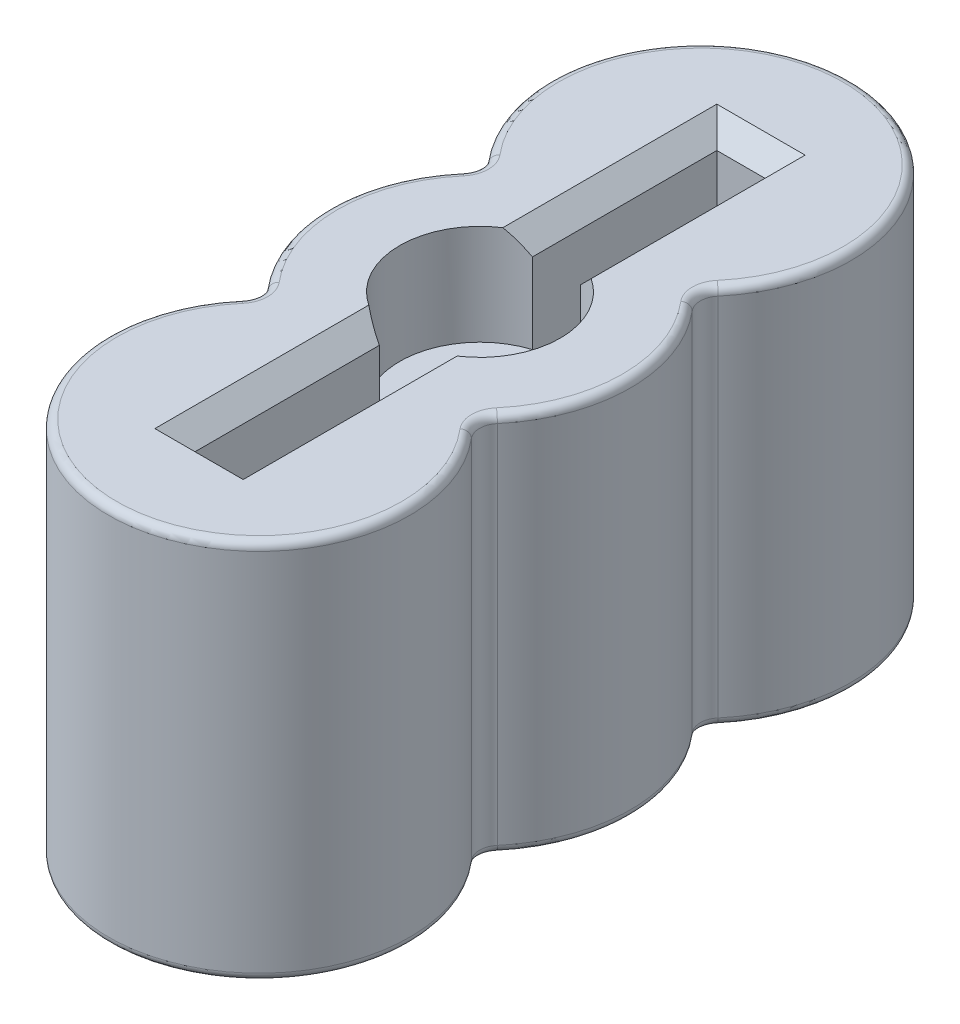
from build123d import *

# Parameters (mm, degrees)
BOSS_EXTRUDE1_DEPTH = 9.5
BOSS_EXTRUDE2_START = -9.5
BOSS_EXTRUDE2_DEPTH = 9.5
SKETCH3_W           = 1.2
SKETCH3_H           = 13
CUT_EXTRUDE1_DEPTH  = 14.77951378
CUT_EXTRUDE2_DEPTH  = 2.5
CUT_EXTRUDE3_START  = -2.5
CUT_EXTRUDE3_DEPTH  = 2.5
CUT_EXTRUDE4_DEPTH  = 2.5
CUT_EXTRUDE5_START  = -2.5
CUT_EXTRUDE5_DEPTH  = 2.5
FILLET1_R           = 0.5
CHAMFER1_SIZE       = 0.5
FILLET2_R           = 0.2


with BuildPart() as part:
    # Sketch1 → Boss-Extrude1 (new body)
    with BuildSketch(Plane.XZ.offset(4.75)):
        with BuildLine():
            ThreePointArc((-2.549509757, 2.75), (0, -3.75), (2.549509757, 2.75))
            ThreePointArc((2.549509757, 2.75), (0, 9.25), (-2.549509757, 2.75))
        make_face()
    extrude(amount=-BOSS_EXTRUDE1_DEPTH)

    # Sketch2 → Boss-Extrude2 (add)
    with BuildSketch(Plane(origin=(0, 4.75, 0), x_dir=(1, 0, 0), z_dir=(0, 1, 0)).offset(BOSS_EXTRUDE2_START)):
        with BuildLine():
            ThreePointArc((2.549509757, 2.75), (0, 9.25), (-2.549509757, 2.75))
            ThreePointArc((-2.549509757, 2.75), (0, 3.75), (2.549509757, 2.75))
        make_face()
    extrude(amount=BOSS_EXTRUDE2_DEPTH)

    # Sketch3 → Cut-Extrude1 (cut, through all)
    with BuildSketch(Plane(origin=(0, 4.75, 0), x_dir=(-1, 0, 0), z_dir=(0, 1, 0))):
        Rectangle(SKETCH3_W, SKETCH3_H)
    extrude(amount=-CUT_EXTRUDE1_DEPTH, mode=Mode.SUBTRACT)

    # Sketch4 → Cut-Extrude2 (cut)
    with BuildSketch(Plane.XZ.offset(4.75)):
        with BuildLine():
            Line((-0.6, -1.907878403), (-0.6, 1.907878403))
            ThreePointArc((-0.6, 1.907878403), (-2, 0), (-0.6, -1.907878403))
        make_face()
    extrude(amount=-CUT_EXTRUDE2_DEPTH, mode=Mode.SUBTRACT)

    # Sketch5 → Cut-Extrude3 (cut)
    with BuildSketch(Plane(origin=(0, 4.75, 0), x_dir=(-1, 0, 0), z_dir=(0, 1, 0)).offset(CUT_EXTRUDE3_START)):
        with BuildLine():
            Line((0.6, 1.907878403), (0.6, -1.907878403))
            ThreePointArc((0.6, -1.907878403), (2, 0), (0.6, 1.907878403))
        make_face()
    extrude(amount=CUT_EXTRUDE3_DEPTH, mode=Mode.SUBTRACT)

    # Sketch6 → Cut-Extrude4 (cut)
    with BuildSketch(Plane.XZ.offset(4.75)):
        with BuildLine():
            Line((0.6, 1.907878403), (0.6, -1.907878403))
            ThreePointArc((0.6, -1.907878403), (2, 0), (0.6, 1.907878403))
        make_face()
    extrude(amount=-CUT_EXTRUDE4_DEPTH, mode=Mode.SUBTRACT)

    # Sketch7 → Cut-Extrude5 (cut)
    with BuildSketch(Plane(origin=(0, 4.75, 0), x_dir=(-1, 0, 0), z_dir=(0, 1, 0)).offset(CUT_EXTRUDE5_START)):
        with BuildLine():
            Line((-0.6, -1.907878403), (-0.6, 1.907878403))
            ThreePointArc((-0.6, 1.907878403), (-2, 0), (-0.6, -1.907878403))
        make_face()
    extrude(amount=CUT_EXTRUDE5_DEPTH, mode=Mode.SUBTRACT)

    # Fillet1
    fillet1_edges = [part.edges().sort_by_distance(p)[0] for p in [
        (2.549509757, 0, -2.75),
        (-2.549509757, 0, -2.75),
        (2.549509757, 0, 2.75),
        (-2.549509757, 0, 2.75),
    ]]
    fillet(fillet1_edges, radius=FILLET1_R)

    # Chamfer1
    chamfer1_edges = [part.edges().sort_by_distance(p)[0] for p in [
        (0.6, -4.75, 4.203939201),
        (0, -4.75, 6.5),
        (-0.6, -4.75, -4.203939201),
        (0, -4.75, -6.5),
        (0.6, 4.75, 4.203939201),
        (0, 4.75, -6.5),
        (-0.6, 4.75, -4.203939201),
        (0, 4.75, 6.5),
        (-0.6, -4.75, 4.203939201),
        (-0.6, 4.75, 4.203939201),
        (0.6, -4.75, -4.203939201),
        (0.6, 4.75, -4.203939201),
    ]]
    chamfer(chamfer1_edges, length=CHAMFER1_SIZE)

    # Fillet2
    fillet2_edges = [part.edges().sort_by_distance(p)[0] for p in [
        (0, -4.75, 9.25),
        (0, 4.75, 9.25),
        (-3.75, -4.75, 0),
        (-3.75, 4.75, 0),
        (3.75, 4.75, 0),
        (3.75, -4.75, 0),
        (0, 4.75, -9.25),
        (0, -4.75, -9.25),
        (-2.740370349, -4.75, 2.75),
        (-2.740370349, 4.75, 2.75),
        (2.740370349, 4.75, -2.75),
        (2.740370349, -4.75, -2.75),
        (-2.740370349, 4.75, -2.75),
        (-2.740370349, -4.75, -2.75),
        (2.740370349, -4.75, 2.75),
        (2.740370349, 4.75, 2.75),
    ]]
    fillet(fillet2_edges, radius=FILLET2_R)


solid = part.part
